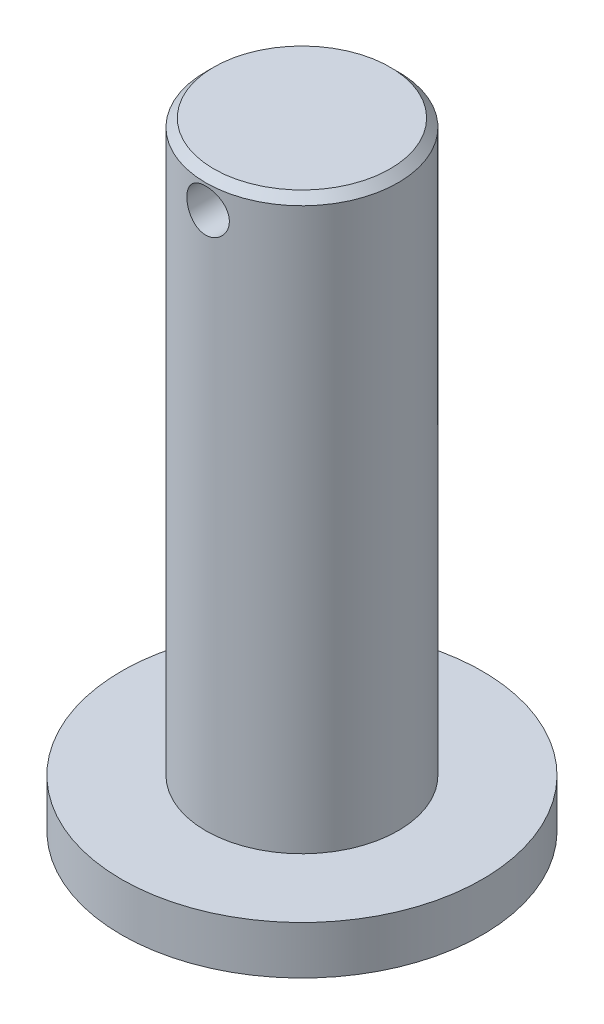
ISO-10303-21;
HEADER;
FILE_DESCRIPTION(('STEP AP214'),'2;1');
FILE_NAME('part.step','',(''),(''),'','','');
FILE_SCHEMA(('AUTOMOTIVE_DESIGN { 1 0 10303 214 1 1 1 1 }'));
ENDSEC;
DATA;
#1=APPLICATION_CONTEXT('core data for automotive mechanical design processes');
#2=APPLICATION_PROTOCOL_DEFINITION('international standard','automotive_design',2000,#1);
#3=PRODUCT_CONTEXT('',#1,'mechanical');
#4=PRODUCT('Part','Part','',(#3));
#5=PRODUCT_RELATED_PRODUCT_CATEGORY('part','',(#4));
#6=PRODUCT_DEFINITION_FORMATION('','',#4);
#7=PRODUCT_DEFINITION_CONTEXT('part definition',#1,'design');
#8=PRODUCT_DEFINITION('design','',#6,#7);
#9=PRODUCT_DEFINITION_SHAPE('','',#8);
#10=(LENGTH_UNIT() NAMED_UNIT(*) SI_UNIT(.MILLI.,.METRE.));
#11=(NAMED_UNIT(*) PLANE_ANGLE_UNIT() SI_UNIT($,.RADIAN.));
#12=(NAMED_UNIT(*) SI_UNIT($,.STERADIAN.) SOLID_ANGLE_UNIT());
#13=UNCERTAINTY_MEASURE_WITH_UNIT(LENGTH_MEASURE(1.E-05),#10,'distance_accuracy_value','');
#14=(GEOMETRIC_REPRESENTATION_CONTEXT(3) GLOBAL_UNCERTAINTY_ASSIGNED_CONTEXT((#13)) GLOBAL_UNIT_ASSIGNED_CONTEXT((#10,
#11,#12)) REPRESENTATION_CONTEXT('',''));
#15=CARTESIAN_POINT('',(0.,0.,0.));
#16=DIRECTION('',(0.,0.,1.));
#17=DIRECTION('',(1.,0.,0.));
#18=AXIS2_PLACEMENT_3D('',#15,#16,#17);
#19=CARTESIAN_POINT('',(0.,6.,0.));
#20=DIRECTION('',(0.,1.,0.));
#21=DIRECTION('',(0.,0.,1.));
#22=AXIS2_PLACEMENT_3D('',#19,#20,#21);
#23=PLANE('',#22);
#24=CARTESIAN_POINT('',(0.,6.,0.));
#25=DIRECTION('',(0.,1.,0.));
#26=DIRECTION('',(0.,0.,1.));
#27=AXIS2_PLACEMENT_3D('',#24,#25,#26);
#28=CIRCLE('',#27,22.5);
#29=CARTESIAN_POINT('',(0.,6.,22.5));
#30=VERTEX_POINT('',#29);
#31=EDGE_CURVE('E45',#30,#30,#28,.T.);
#32=ORIENTED_EDGE('',*,*,#31,.T.);
#33=EDGE_LOOP('',(#32));
#34=FACE_BOUND('',#33,.T.);
#35=CARTESIAN_POINT('',(0.,6.,0.));
#36=DIRECTION('',(0.,1.,0.));
#37=DIRECTION('',(0.,0.,1.));
#38=AXIS2_PLACEMENT_3D('',#35,#36,#37);
#39=CIRCLE('',#38,12.);
#40=CARTESIAN_POINT('',(0.,6.,12.));
#41=VERTEX_POINT('',#40);
#42=EDGE_CURVE('E89',#41,#41,#39,.T.);
#43=ORIENTED_EDGE('',*,*,#42,.F.);
#44=EDGE_LOOP('',(#43));
#45=FACE_BOUND('',#44,.T.);
#46=ADVANCED_FACE('F28',(#34,#45),#23,.T.);
#47=CARTESIAN_POINT('',(0.,6.,0.));
#48=DIRECTION('',(0.,-1.,0.));
#49=DIRECTION('',(0.,0.,-1.));
#50=AXIS2_PLACEMENT_3D('',#47,#48,#49);
#51=CYLINDRICAL_SURFACE('',#50,22.5);
#52=ORIENTED_EDGE('',*,*,#31,.F.);
#53=EDGE_LOOP('',(#52));
#54=FACE_BOUND('',#53,.T.);
#55=CARTESIAN_POINT('',(0.,0.,0.));
#56=DIRECTION('',(0.,1.,0.));
#57=DIRECTION('',(0.,0.,1.));
#58=AXIS2_PLACEMENT_3D('',#55,#56,#57);
#59=CIRCLE('',#58,22.5);
#60=CARTESIAN_POINT('',(0.,0.,22.5));
#61=VERTEX_POINT('',#60);
#62=EDGE_CURVE('E87',#61,#61,#59,.T.);
#63=ORIENTED_EDGE('',*,*,#62,.T.);
#64=EDGE_LOOP('',(#63));
#65=FACE_BOUND('',#64,.T.);
#66=ADVANCED_FACE('F72',(#54,#65),#51,.T.);
#67=CARTESIAN_POINT('',(0.,0.,0.));
#68=DIRECTION('',(0.,1.,0.));
#69=DIRECTION('',(0.,0.,1.));
#70=AXIS2_PLACEMENT_3D('',#67,#68,#69);
#71=PLANE('',#70);
#72=ORIENTED_EDGE('',*,*,#62,.F.);
#73=EDGE_LOOP('',(#72));
#74=FACE_BOUND('',#73,.T.);
#75=ADVANCED_FACE('F69',(#74),#71,.F.);
#76=CARTESIAN_POINT('',(0.,77.,0.));
#77=DIRECTION('',(0.,-1.,0.));
#78=DIRECTION('',(0.,0.,-1.));
#79=AXIS2_PLACEMENT_3D('',#76,#77,#78);
#80=CYLINDRICAL_SURFACE('',#79,12.);
#81=CARTESIAN_POINT('',(0.,75.65,-12.));
#82=CARTESIAN_POINT('',(-0.146940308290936,75.6499950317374,-11.9999972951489));
#83=CARTESIAN_POINT('',(-0.293940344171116,75.6377371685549,-11.9972736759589));
#84=CARTESIAN_POINT('',(-0.583762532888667,75.5890819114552,-11.9866717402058));
#85=CARTESIAN_POINT('',(-0.726581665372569,75.5526674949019,-11.9787897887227));
#86=CARTESIAN_POINT('',(-1.00381183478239,75.4568971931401,-11.9587484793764));
#87=CARTESIAN_POINT('',(-1.13823156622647,75.397565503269,-11.946593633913));
#88=CARTESIAN_POINT('',(-1.39520413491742,75.2577221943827,-11.9193172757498));
#89=CARTESIAN_POINT('',(-1.51775723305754,75.1772110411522,-11.9041958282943));
#90=CARTESIAN_POINT('',(-1.74952440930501,74.9959023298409,-11.8723656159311));
#91=CARTESIAN_POINT('',(-1.85851685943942,74.8948249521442,-11.8556368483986));
#92=CARTESIAN_POINT('',(-2.05814683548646,74.6758536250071,-11.8226178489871));
#93=CARTESIAN_POINT('',(-2.14878269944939,74.557958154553,-11.806327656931));
#94=CARTESIAN_POINT('',(-2.31010859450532,74.3070533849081,-11.775832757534));
#95=CARTESIAN_POINT('',(-2.38056192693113,74.1738885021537,-11.7616536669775));
#96=CARTESIAN_POINT('',(-2.49800430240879,73.8972444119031,-11.7372737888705));
#97=CARTESIAN_POINT('',(-2.54499620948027,73.7537664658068,-11.7270725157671));
#98=CARTESIAN_POINT('',(-2.61344784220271,73.4629753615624,-11.7120071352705));
#99=CARTESIAN_POINT('',(-2.63530036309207,73.3157590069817,-11.7070610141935));
#100=CARTESIAN_POINT('',(-2.65407439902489,73.019672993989,-11.7028196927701));
#101=CARTESIAN_POINT('',(-2.65099903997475,72.8708035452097,-11.7035237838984));
#102=CARTESIAN_POINT('',(-2.62032054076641,72.5785629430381,-11.7104291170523));
#103=CARTESIAN_POINT('',(-2.59317443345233,72.4351410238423,-11.7165279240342));
#104=CARTESIAN_POINT('',(-2.515849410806,72.1549386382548,-11.7333734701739));
#105=CARTESIAN_POINT('',(-2.46566918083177,72.0181585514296,-11.7441204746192));
#106=CARTESIAN_POINT('',(-2.34328263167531,71.75384147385,-11.7691519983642));
#107=CARTESIAN_POINT('',(-2.27090120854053,71.6263883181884,-11.7834644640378));
#108=CARTESIAN_POINT('',(-2.10628999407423,71.3852681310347,-11.8139972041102));
#109=CARTESIAN_POINT('',(-2.01405744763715,71.2716030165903,-11.8302177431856));
#110=CARTESIAN_POINT('',(-1.80994612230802,71.0586549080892,-11.863177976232));
#111=CARTESIAN_POINT('',(-1.69767889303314,70.9597444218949,-11.8799212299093));
#112=CARTESIAN_POINT('',(-1.4579600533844,70.7820936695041,-11.9117147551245));
#113=CARTESIAN_POINT('',(-1.33050815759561,70.7033537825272,-11.9267649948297));
#114=CARTESIAN_POINT('',(-1.06357834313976,70.5681845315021,-11.9535270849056));
#115=CARTESIAN_POINT('',(-0.924074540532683,70.5118047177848,-11.9652315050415));
#116=CARTESIAN_POINT('',(-0.637257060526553,70.4233908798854,-11.9839280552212));
#117=CARTESIAN_POINT('',(-0.489944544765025,70.3913532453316,-11.9909208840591));
#118=CARTESIAN_POINT('',(-0.194885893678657,70.3530767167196,-11.9993066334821));
#119=CARTESIAN_POINT('',(-0.0472088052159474,70.3463290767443,-12.0008099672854));
#120=CARTESIAN_POINT('',(0.247162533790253,70.3574441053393,-11.9983570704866));
#121=CARTESIAN_POINT('',(0.393856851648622,70.3753050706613,-11.994401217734));
#122=CARTESIAN_POINT('',(0.680407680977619,70.4347085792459,-11.9815441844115));
#123=CARTESIAN_POINT('',(0.82032238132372,70.4759836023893,-11.9726988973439));
#124=CARTESIAN_POINT('',(1.09124209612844,70.5807460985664,-11.9510533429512));
#125=CARTESIAN_POINT('',(1.22224634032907,70.6442354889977,-11.9382527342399));
#126=CARTESIAN_POINT('',(1.47372507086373,70.7926797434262,-11.9098445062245));
#127=CARTESIAN_POINT('',(1.59401926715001,70.8779325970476,-11.8941988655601));
#128=CARTESIAN_POINT('',(1.8187765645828,71.0670921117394,-11.8619124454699));
#129=CARTESIAN_POINT('',(1.92323756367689,71.1710012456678,-11.8452715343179));
#130=CARTESIAN_POINT('',(2.11538008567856,71.3968602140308,-11.8124876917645));
#131=CARTESIAN_POINT('',(2.20270900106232,71.5191126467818,-11.7963600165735));
#132=CARTESIAN_POINT('',(2.35559835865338,71.7768470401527,-11.7667856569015));
#133=CARTESIAN_POINT('',(2.42115974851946,71.9123284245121,-11.7533388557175));
#134=CARTESIAN_POINT('',(2.52820614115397,72.1919453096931,-11.7307786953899));
#135=CARTESIAN_POINT('',(2.56982743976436,72.3360265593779,-11.7216408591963));
#136=CARTESIAN_POINT('',(2.62820946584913,72.6293661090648,-11.7086901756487));
#137=CARTESIAN_POINT('',(2.64497425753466,72.778623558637,-11.7048764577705));
#138=CARTESIAN_POINT('',(2.65299181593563,73.074521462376,-11.7030614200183));
#139=CARTESIAN_POINT('',(2.64480391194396,73.2211462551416,-11.7049326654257));
#140=CARTESIAN_POINT('',(2.60440081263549,73.5108713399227,-11.7139881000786));
#141=CARTESIAN_POINT('',(2.57218591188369,73.6539716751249,-11.7211722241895));
#142=CARTESIAN_POINT('',(2.48491586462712,73.9321310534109,-11.7399812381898));
#143=CARTESIAN_POINT('',(2.42994361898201,74.0672172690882,-11.7515899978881));
#144=CARTESIAN_POINT('',(2.29879000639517,74.3263320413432,-11.7779462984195));
#145=CARTESIAN_POINT('',(2.22260638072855,74.4503594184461,-11.7926941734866));
#146=CARTESIAN_POINT('',(2.04934387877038,74.6865897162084,-11.8240465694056));
#147=CARTESIAN_POINT('',(1.9518670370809,74.798496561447,-11.8406830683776));
#148=CARTESIAN_POINT('',(1.73958969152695,75.0045479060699,-11.8737249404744));
#149=CARTESIAN_POINT('',(1.62478518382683,75.0986882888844,-11.8901302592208));
#150=CARTESIAN_POINT('',(1.37927376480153,75.2677328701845,-11.9211198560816));
#151=CARTESIAN_POINT('',(1.24837591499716,75.3423650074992,-11.9356770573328));
#152=CARTESIAN_POINT('',(0.97559859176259,75.4684496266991,-11.9610578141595));
#153=CARTESIAN_POINT('',(0.833728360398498,75.5199213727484,-11.9718844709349));
#154=CARTESIAN_POINT('',(0.576449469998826,75.5891464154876,-11.986673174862));
#155=CARTESIAN_POINT('',(0.462423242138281,75.6119226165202,-11.9916395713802));
#156=CARTESIAN_POINT('',(0.232277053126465,75.642351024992,-11.9983039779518));
#157=CARTESIAN_POINT('',(0.116157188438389,75.6500039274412,-12.0000021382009));
#158=CARTESIAN_POINT('',(0.,75.65,-12.));
#159=B_SPLINE_CURVE_WITH_KNOTS('',3,(#81,#82,#83,#84,#85,#86,#87,#88,#89,#90,#91,#92,#93,#94,
#95,#96,#97,#98,#99,#100,#101,#102,#103,#104,#105,#106,#107,#108,#109,#110,#111,#112,#113,#114,
#115,#116,#117,#118,#119,#120,#121,#122,#123,#124,#125,#126,#127,#128,#129,#130,#131,#132,#133,
#134,#135,#136,#137,#138,#139,#140,#141,#142,#143,#144,#145,#146,#147,#148,#149,#150,#151,#152,
#153,#154,#155,#156,#157,#158),.UNSPECIFIED.,.T.,.F.,(4,2,2,2,2,2,2,2,2,2,2,2,2,2,2,2,2,2,2,2,2,
2,2,2,2,2,2,2,2,2,2,2,2,2,2,2,2,2,4),(0.,0.44039571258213,0.8811020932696,1.32134445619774,
1.76157713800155,2.20825685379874,2.6549769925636,3.10673973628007,3.55844731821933,
4.0029969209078,4.44749077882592,4.88372152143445,5.31997716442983,5.75976616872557,
6.19961625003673,6.6491676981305,7.0987275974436,7.54927823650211,7.99976203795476,
8.4411334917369,8.88247439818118,9.31887144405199,9.7553061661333,10.1980711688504,
10.6408949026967,11.0920486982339,11.5431828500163,11.9917225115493,12.440188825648,
12.8786770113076,13.3171598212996,13.7540591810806,14.1910050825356,14.636948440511,
15.0829949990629,15.5349651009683,15.9865585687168,16.3347100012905,16.6828454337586),.UNSPECIFIED.);
#160=CARTESIAN_POINT('',(0.,75.65,-12.));
#161=VERTEX_POINT('',#160);
#162=EDGE_CURVE('E32',#161,#161,#159,.T.);
#163=ORIENTED_EDGE('',*,*,#162,.T.);
#164=EDGE_LOOP('',(#163));
#165=FACE_BOUND('',#164,.T.);
#166=CARTESIAN_POINT('',(2.65,73.,11.7037387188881));
#167=CARTESIAN_POINT('',(2.64999499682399,72.8531089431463,11.7037416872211));
#168=CARTESIAN_POINT('',(2.63774507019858,72.7061580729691,11.7065342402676));
#169=CARTESIAN_POINT('',(2.58912419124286,72.4164379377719,11.7173816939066));
#170=CARTESIAN_POINT('',(2.55273601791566,72.273671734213,11.7254403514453));
#171=CARTESIAN_POINT('',(2.45704242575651,71.996553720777,11.74586383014));
#172=CARTESIAN_POINT('',(2.39776243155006,71.8621927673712,11.7582238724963));
#173=CARTESIAN_POINT('',(2.25804102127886,71.6053194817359,11.7858516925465));
#174=CARTESIAN_POINT('',(2.17759995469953,71.4828069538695,11.8011194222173));
#175=CARTESIAN_POINT('',(1.99636344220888,71.2509973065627,11.8331360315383));
#176=CARTESIAN_POINT('',(1.89527241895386,71.1419338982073,11.849904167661));
#177=CARTESIAN_POINT('',(1.67624358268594,70.9421660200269,11.8828637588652));
#178=CARTESIAN_POINT('',(1.558304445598,70.8514629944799,11.8990551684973));
#179=CARTESIAN_POINT('',(1.30735811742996,70.6900641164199,11.9292468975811));
#180=CARTESIAN_POINT('',(1.17420284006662,70.6195933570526,11.9432218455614));
#181=CARTESIAN_POINT('',(0.897579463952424,70.5021161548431,11.9671883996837));
#182=CARTESIAN_POINT('',(0.754112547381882,70.4551070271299,11.9771804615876));
#183=CARTESIAN_POINT('',(0.463368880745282,70.3866234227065,11.9919193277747));
#184=CARTESIAN_POINT('',(0.316189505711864,70.3647533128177,11.996747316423));
#185=CARTESIAN_POINT('',(0.0201769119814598,70.3459312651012,12.0008954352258));
#186=CARTESIAN_POINT('',(-0.128656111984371,70.3489764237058,12.0002162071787));
#187=CARTESIAN_POINT('',(-0.421022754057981,70.3796044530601,11.9934883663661));
#188=CARTESIAN_POINT('',(-0.564603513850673,70.4067608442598,11.9875330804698));
#189=CARTESIAN_POINT('',(-0.845118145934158,70.4841604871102,11.9710287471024));
#190=CARTESIAN_POINT('',(-0.982051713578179,70.5344047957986,11.9604794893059));
#191=CARTESIAN_POINT('',(-1.24656498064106,70.6569291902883,11.9358229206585));
#192=CARTESIAN_POINT('',(-1.37406758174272,70.7293703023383,11.9216897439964));
#193=CARTESIAN_POINT('',(-1.61526191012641,70.8941117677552,11.891413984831));
#194=CARTESIAN_POINT('',(-1.7289517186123,70.9864148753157,11.8752711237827));
#195=CARTESIAN_POINT('',(-1.9418302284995,71.1905798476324,11.8423460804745));
#196=CARTESIAN_POINT('',(-2.04066031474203,71.3028149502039,11.8255576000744));
#197=CARTESIAN_POINT('',(-2.21816367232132,71.5424396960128,11.7935536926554));
#198=CARTESIAN_POINT('',(-2.29683637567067,71.6698297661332,11.7783383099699));
#199=CARTESIAN_POINT('',(-2.43195545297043,71.9367358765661,11.7511862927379));
#200=CARTESIAN_POINT('',(-2.48833288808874,72.0762879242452,11.739259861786));
#201=CARTESIAN_POINT('',(-2.57672753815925,72.3632112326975,11.7201766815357));
#202=CARTESIAN_POINT('',(-2.60874870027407,72.510581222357,11.7130191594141));
#203=CARTESIAN_POINT('',(-2.64696315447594,72.8056771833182,11.7044421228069));
#204=CARTESIAN_POINT('',(-2.65367912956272,72.9533321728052,11.7029065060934));
#205=CARTESIAN_POINT('',(-2.6425086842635,73.2476520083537,11.7054337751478));
#206=CARTESIAN_POINT('',(-2.62462398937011,73.394316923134,11.7094962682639));
#207=CARTESIAN_POINT('',(-2.56521369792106,73.6806657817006,11.7226522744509));
#208=CARTESIAN_POINT('',(-2.52397701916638,73.8204127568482,11.7316842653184));
#209=CARTESIAN_POINT('',(-2.41934661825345,74.0910137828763,11.7537059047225));
#210=CARTESIAN_POINT('',(-2.35595074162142,74.2218669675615,11.7666959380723));
#211=CARTESIAN_POINT('',(-2.20765364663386,74.4732248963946,11.795424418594));
#212=CARTESIAN_POINT('',(-2.12243104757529,74.5935353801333,11.8112027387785));
#213=CARTESIAN_POINT('',(-1.93331927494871,74.8183393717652,11.843625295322));
#214=CARTESIAN_POINT('',(-1.82942773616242,74.9228308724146,11.8602696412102));
#215=CARTESIAN_POINT('',(-1.60355979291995,75.1150651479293,11.8929322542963));
#216=CARTESIAN_POINT('',(-1.48127677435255,75.2024512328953,11.9089325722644));
#217=CARTESIAN_POINT('',(-1.22346344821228,75.3554408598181,11.9381716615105));
#218=CARTESIAN_POINT('',(-1.08793376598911,75.4210454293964,11.9514105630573));
#219=CARTESIAN_POINT('',(-0.808326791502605,75.5281158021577,11.9735595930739));
#220=CARTESIAN_POINT('',(-0.664310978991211,75.5697361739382,11.9824973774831));
#221=CARTESIAN_POINT('',(-0.371111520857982,75.6281384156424,11.9951568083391));
#222=CARTESIAN_POINT('',(-0.221928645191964,75.6449239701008,11.9988792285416));
#223=CARTESIAN_POINT('',(0.0739863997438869,75.6530117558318,12.0006649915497));
#224=CARTESIAN_POINT('',(0.220703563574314,75.6448461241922,11.9988465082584));
#225=CARTESIAN_POINT('',(0.510619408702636,75.6044554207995,11.9900085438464));
#226=CARTESIAN_POINT('',(0.653818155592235,75.5722307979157,11.982989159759));
#227=CARTESIAN_POINT('',(0.932211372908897,75.4848939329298,11.9645474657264));
#228=CARTESIAN_POINT('',(1.06743098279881,75.4298585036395,11.9531399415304));
#229=CARTESIAN_POINT('',(1.32678687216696,75.298536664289,11.9271389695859));
#230=CARTESIAN_POINT('',(1.45092205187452,75.2222481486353,11.9125452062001));
#231=CARTESIAN_POINT('',(1.68717658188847,75.0488576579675,11.8814108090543));
#232=CARTESIAN_POINT('',(1.79901767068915,74.9513822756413,11.8648380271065));
#233=CARTESIAN_POINT('',(2.00493704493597,74.7391364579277,11.8317846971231));
#234=CARTESIAN_POINT('',(2.09901103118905,74.6243618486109,11.8153041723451));
#235=CARTESIAN_POINT('',(2.26796812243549,74.3788859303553,11.7840495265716));
#236=CARTESIAN_POINT('',(2.34257090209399,74.2479881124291,11.7693018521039));
#237=CARTESIAN_POINT('',(2.46860064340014,73.9752141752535,11.7435165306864));
#238=CARTESIAN_POINT('',(2.52004704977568,73.8333473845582,11.7324757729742));
#239=CARTESIAN_POINT('',(2.58921382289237,73.5761323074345,11.7173760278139));
#240=CARTESIAN_POINT('',(2.61196456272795,73.4621699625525,11.7122962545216));
#241=CARTESIAN_POINT('',(2.64235924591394,73.2321507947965,11.7054765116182));
#242=CARTESIAN_POINT('',(2.65000395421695,73.1160940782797,11.7037363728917));
#243=CARTESIAN_POINT('',(2.65,73.,11.7037387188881));
#244=B_SPLINE_CURVE_WITH_KNOTS('',3,(#166,#167,#168,#169,#170,#171,#172,#173,#174,#175,#176,
#177,#178,#179,#180,#181,#182,#183,#184,#185,#186,#187,#188,#189,#190,#191,#192,#193,#194,#195,
#196,#197,#198,#199,#200,#201,#202,#203,#204,#205,#206,#207,#208,#209,#210,#211,#212,#213,#214,
#215,#216,#217,#218,#219,#220,#221,#222,#223,#224,#225,#226,#227,#228,#229,#230,#231,#232,#233,
#234,#235,#236,#237,#238,#239,#240,#241,#242,#243),.UNSPECIFIED.,.T.,.F.,(4,2,2,2,2,2,2,2,2,2,2,
2,2,2,2,2,2,2,2,2,2,2,2,2,2,2,2,2,2,2,2,2,2,2,2,2,2,2,4),(0.,0.440247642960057,
0.880809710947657,1.32088387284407,1.76095076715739,2.20782417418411,2.65473271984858,
3.10643605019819,3.55808767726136,4.00252954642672,4.44691962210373,4.8836025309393,
5.32030543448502,5.76025456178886,6.20026473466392,6.64960528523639,7.0989584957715,
7.54969047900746,8.00034940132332,8.44164718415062,8.88291401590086,9.31883703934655,
9.75480245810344,10.1975985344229,10.6404507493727,11.0917330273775,11.5429940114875,
11.9913133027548,12.4395660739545,12.8783261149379,13.3170779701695,13.7543642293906,
14.1916938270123,14.6374669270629,15.0833477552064,15.5353321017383,15.9869361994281,
16.3348997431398,16.6828456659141),.UNSPECIFIED.);
#245=CARTESIAN_POINT('',(2.65,73.,11.7037387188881));
#246=VERTEX_POINT('',#245);
#247=EDGE_CURVE('E48',#246,#246,#244,.T.);
#248=ORIENTED_EDGE('',*,*,#247,.T.);
#249=EDGE_LOOP('',(#248));
#250=FACE_BOUND('',#249,.T.);
#251=CARTESIAN_POINT('',(0.,76.,0.));
#252=DIRECTION('',(0.,1.,0.));
#253=DIRECTION('',(0.,0.,1.));
#254=AXIS2_PLACEMENT_3D('',#251,#252,#253);
#255=CIRCLE('',#254,12.);
#256=CARTESIAN_POINT('',(0.,76.,12.));
#257=VERTEX_POINT('',#256);
#258=EDGE_CURVE('E10',#257,#257,#255,.F.);
#259=ORIENTED_EDGE('',*,*,#258,.T.);
#260=EDGE_LOOP('',(#259));
#261=FACE_BOUND('',#260,.T.);
#262=ORIENTED_EDGE('',*,*,#42,.T.);
#263=EDGE_LOOP('',(#262));
#264=FACE_BOUND('',#263,.T.);
#265=ADVANCED_FACE('F52',(#165,#250,#261,#264),#80,.T.);
#266=CARTESIAN_POINT('',(0.,77.,0.));
#267=DIRECTION('',(0.,1.,0.));
#268=DIRECTION('',(0.,0.,1.));
#269=AXIS2_PLACEMENT_3D('',#266,#267,#268);
#270=PLANE('',#269);
#271=CARTESIAN_POINT('',(0.,77.,0.));
#272=DIRECTION('',(0.,1.,0.));
#273=DIRECTION('',(0.,0.,1.));
#274=AXIS2_PLACEMENT_3D('',#271,#272,#273);
#275=CIRCLE('',#274,11.);
#276=CARTESIAN_POINT('',(0.,77.,11.));
#277=VERTEX_POINT('',#276);
#278=EDGE_CURVE('E40',#277,#277,#275,.T.);
#279=ORIENTED_EDGE('',*,*,#278,.T.);
#280=EDGE_LOOP('',(#279));
#281=FACE_BOUND('',#280,.T.);
#282=ADVANCED_FACE('F60',(#281),#270,.T.);
#283=CARTESIAN_POINT('',(0.,77.,0.));
#284=DIRECTION('',(0.,-1.,0.));
#285=DIRECTION('',(0.,0.,-1.));
#286=AXIS2_PLACEMENT_3D('',#283,#284,#285);
#287=CONICAL_SURFACE('',#286,11.,0.785398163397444);
#288=ORIENTED_EDGE('',*,*,#258,.F.);
#289=EDGE_LOOP('',(#288));
#290=FACE_BOUND('',#289,.T.);
#291=ORIENTED_EDGE('',*,*,#278,.F.);
#292=EDGE_LOOP('',(#291));
#293=FACE_BOUND('',#292,.T.);
#294=ADVANCED_FACE('F30',(#290,#293),#287,.T.);
#295=CARTESIAN_POINT('',(0.,73.,-35.5));
#296=DIRECTION('',(0.,0.,1.));
#297=DIRECTION('',(1.,0.,0.));
#298=AXIS2_PLACEMENT_3D('',#295,#296,#297);
#299=CYLINDRICAL_SURFACE('',#298,2.65);
#300=ORIENTED_EDGE('',*,*,#247,.F.);
#301=EDGE_LOOP('',(#300));
#302=FACE_BOUND('',#301,.T.);
#303=ORIENTED_EDGE('',*,*,#162,.F.);
#304=EDGE_LOOP('',(#303));
#305=FACE_BOUND('',#304,.T.);
#306=ADVANCED_FACE('F56',(#302,#305),#299,.F.);
#307=CLOSED_SHELL('',(#46,#66,#75,#265,#282,#294,#306));
#308=MANIFOLD_SOLID_BREP('B2',#307);
#309=ADVANCED_BREP_SHAPE_REPRESENTATION('',(#18,#308),#14);
#310=SHAPE_DEFINITION_REPRESENTATION(#9,#309);
ENDSEC;
END-ISO-10303-21;
